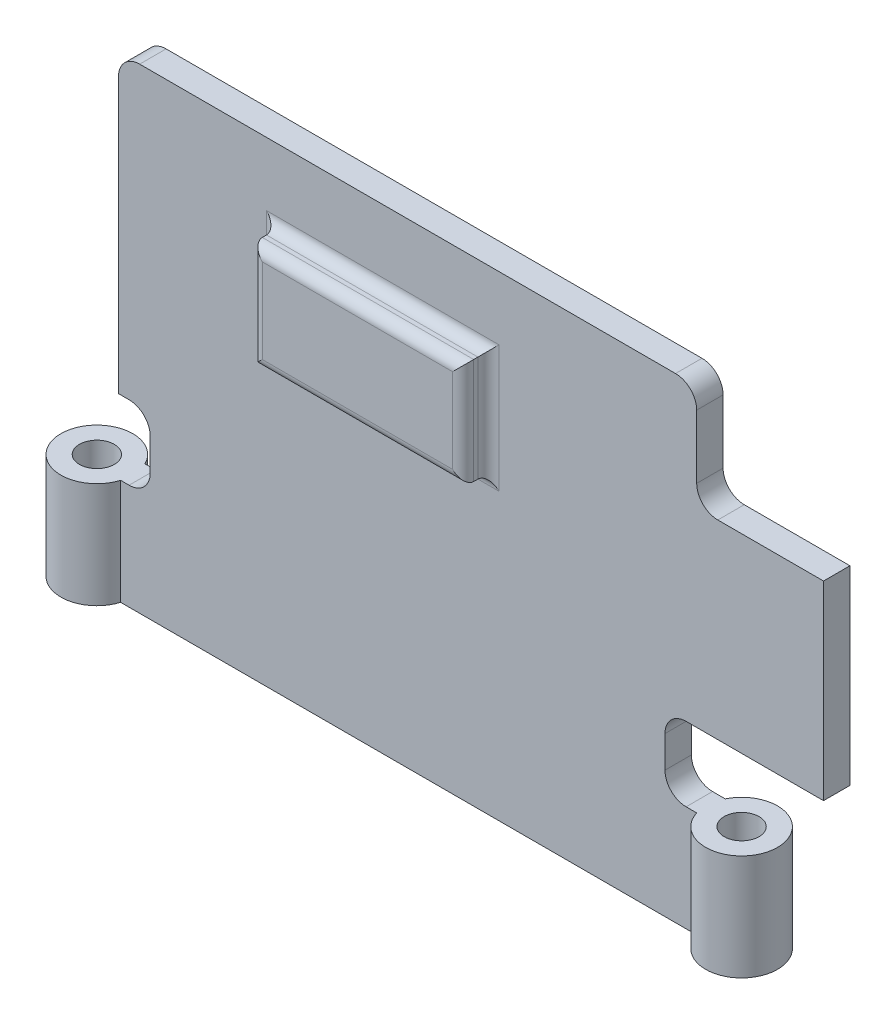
ISO-10303-21;
HEADER;
FILE_DESCRIPTION(('STEP AP214'),'2;1');
FILE_NAME('part.step','',(''),(''),'','','');
FILE_SCHEMA(('AUTOMOTIVE_DESIGN { 1 0 10303 214 1 1 1 1 }'));
ENDSEC;
DATA;
#1=APPLICATION_CONTEXT('core data for automotive mechanical design processes');
#2=APPLICATION_PROTOCOL_DEFINITION('international standard','automotive_design',2000,#1);
#3=PRODUCT_CONTEXT('',#1,'mechanical');
#4=PRODUCT('Part','Part','',(#3));
#5=PRODUCT_RELATED_PRODUCT_CATEGORY('part','',(#4));
#6=PRODUCT_DEFINITION_FORMATION('','',#4);
#7=PRODUCT_DEFINITION_CONTEXT('part definition',#1,'design');
#8=PRODUCT_DEFINITION('design','',#6,#7);
#9=PRODUCT_DEFINITION_SHAPE('','',#8);
#10=(LENGTH_UNIT() NAMED_UNIT(*) SI_UNIT(.MILLI.,.METRE.));
#11=(NAMED_UNIT(*) PLANE_ANGLE_UNIT() SI_UNIT($,.RADIAN.));
#12=(NAMED_UNIT(*) SI_UNIT($,.STERADIAN.) SOLID_ANGLE_UNIT());
#13=UNCERTAINTY_MEASURE_WITH_UNIT(LENGTH_MEASURE(1.E-05),#10,'distance_accuracy_value','');
#14=(GEOMETRIC_REPRESENTATION_CONTEXT(3) GLOBAL_UNCERTAINTY_ASSIGNED_CONTEXT((#13)) GLOBAL_UNIT_ASSIGNED_CONTEXT((#10,
#11,#12)) REPRESENTATION_CONTEXT('',''));
#15=CARTESIAN_POINT('',(0.,0.,0.));
#16=DIRECTION('',(0.,0.,1.));
#17=DIRECTION('',(1.,0.,0.));
#18=AXIS2_PLACEMENT_3D('',#15,#16,#17);
#19=CARTESIAN_POINT('',(-27.2503846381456,10.,1.));
#20=DIRECTION('',(0.,0.,-1.));
#21=DIRECTION('',(-1.,0.,0.));
#22=AXIS2_PLACEMENT_3D('',#19,#20,#21);
#23=PLANE('',#22);
#24=DIRECTION('',(-1.,0.,0.));
#25=VECTOR('',#24,1.);
#26=CARTESIAN_POINT('',(7.55122926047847,39.,1.));
#27=LINE('',#26,#25);
#28=CARTESIAN_POINT('',(-13.4487707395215,39.,1.));
#29=VERTEX_POINT('',#28);
#30=CARTESIAN_POINT('',(8.55122926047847,39.,1.));
#31=VERTEX_POINT('',#30);
#32=EDGE_CURVE('E533',#29,#31,#27,.F.);
#33=ORIENTED_EDGE('',*,*,#32,.T.);
#34=DIRECTION('',(0.,1.,0.));
#35=VECTOR('',#34,1.);
#36=CARTESIAN_POINT('',(8.55122926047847,28.,1.));
#37=LINE('',#36,#35);
#38=CARTESIAN_POINT('',(8.55122926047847,27.,1.));
#39=VERTEX_POINT('',#38);
#40=EDGE_CURVE('E11',#31,#39,#37,.F.);
#41=ORIENTED_EDGE('',*,*,#40,.T.);
#42=DIRECTION('',(1.,0.,0.));
#43=VECTOR('',#42,1.);
#44=CARTESIAN_POINT('',(-12.4487707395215,27.,1.));
#45=LINE('',#44,#43);
#46=CARTESIAN_POINT('',(-13.4487707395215,27.,1.));
#47=VERTEX_POINT('',#46);
#48=EDGE_CURVE('E44',#39,#47,#45,.F.);
#49=ORIENTED_EDGE('',*,*,#48,.T.);
#50=DIRECTION('',(0.,-1.,0.));
#51=VECTOR('',#50,1.);
#52=CARTESIAN_POINT('',(-13.4487707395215,38.,1.));
#53=LINE('',#52,#51);
#54=EDGE_CURVE('E535',#47,#29,#53,.F.);
#55=ORIENTED_EDGE('',*,*,#54,.T.);
#56=EDGE_LOOP('',(#33,#41,#49,#55));
#57=FACE_BOUND('',#56,.T.);
#58=DIRECTION('',(0.,-1.,0.));
#59=VECTOR('',#58,1.);
#60=CARTESIAN_POINT('',(27.2503846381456,45.,1.));
#61=LINE('',#60,#59);
#62=CARTESIAN_POINT('',(27.2503846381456,43.,1.));
#63=VERTEX_POINT('',#62);
#64=CARTESIAN_POINT('',(27.2503846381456,37.,1.));
#65=VERTEX_POINT('',#64);
#66=EDGE_CURVE('E395',#63,#65,#61,.T.);
#67=ORIENTED_EDGE('',*,*,#66,.F.);
#68=CARTESIAN_POINT('',(25.2503846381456,43.,1.));
#69=DIRECTION('',(0.,0.,-1.));
#70=DIRECTION('',(-1.,0.,0.));
#71=AXIS2_PLACEMENT_3D('',#68,#69,#70);
#72=CIRCLE('',#71,2.);
#73=CARTESIAN_POINT('',(25.2503846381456,45.,1.));
#74=VERTEX_POINT('',#73);
#75=EDGE_CURVE('E472',#63,#74,#72,.F.);
#76=ORIENTED_EDGE('',*,*,#75,.T.);
#77=DIRECTION('',(1.,0.,0.));
#78=VECTOR('',#77,1.);
#79=CARTESIAN_POINT('',(-27.4487707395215,45.,1.));
#80=LINE('',#79,#78);
#81=CARTESIAN_POINT('',(-25.4487707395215,45.,1.));
#82=VERTEX_POINT('',#81);
#83=EDGE_CURVE('E379',#82,#74,#80,.T.);
#84=ORIENTED_EDGE('',*,*,#83,.F.);
#85=CARTESIAN_POINT('',(-25.4487707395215,43.,1.));
#86=DIRECTION('',(0.,0.,-1.));
#87=DIRECTION('',(-1.,0.,0.));
#88=AXIS2_PLACEMENT_3D('',#85,#86,#87);
#89=CIRCLE('',#88,2.);
#90=CARTESIAN_POINT('',(-27.4487707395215,43.,1.));
#91=VERTEX_POINT('',#90);
#92=EDGE_CURVE('E470',#82,#91,#89,.F.);
#93=ORIENTED_EDGE('',*,*,#92,.T.);
#94=DIRECTION('',(0.,-1.,0.));
#95=VECTOR('',#94,1.);
#96=CARTESIAN_POINT('',(-27.4487707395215,45.,1.));
#97=LINE('',#96,#95);
#98=CARTESIAN_POINT('',(-27.4487707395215,17.,1.));
#99=VERTEX_POINT('',#98);
#100=EDGE_CURVE('E398',#91,#99,#97,.T.);
#101=ORIENTED_EDGE('',*,*,#100,.T.);
#102=DIRECTION('',(-1.,0.,0.));
#103=VECTOR('',#102,1.);
#104=CARTESIAN_POINT('',(-24.4487707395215,17.,1.));
#105=LINE('',#104,#103);
#106=CARTESIAN_POINT('',(-26.4487707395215,17.,1.));
#107=VERTEX_POINT('',#106);
#108=EDGE_CURVE('E380',#107,#99,#105,.T.);
#109=ORIENTED_EDGE('',*,*,#108,.F.);
#110=CARTESIAN_POINT('',(-26.4487707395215,15.,1.));
#111=DIRECTION('',(0.,0.,-1.));
#112=DIRECTION('',(-1.,0.,0.));
#113=AXIS2_PLACEMENT_3D('',#110,#111,#112);
#114=CIRCLE('',#113,2.);
#115=CARTESIAN_POINT('',(-24.4487707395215,15.,1.));
#116=VERTEX_POINT('',#115);
#117=EDGE_CURVE('E500',#107,#116,#114,.T.);
#118=ORIENTED_EDGE('',*,*,#117,.T.);
#119=DIRECTION('',(0.,1.,0.));
#120=VECTOR('',#119,1.);
#121=CARTESIAN_POINT('',(-24.4487707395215,10.,1.));
#122=LINE('',#121,#120);
#123=CARTESIAN_POINT('',(-24.4487707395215,12.,1.));
#124=VERTEX_POINT('',#123);
#125=EDGE_CURVE('E370',#124,#116,#122,.T.);
#126=ORIENTED_EDGE('',*,*,#125,.F.);
#127=CARTESIAN_POINT('',(-26.4487707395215,12.,1.));
#128=DIRECTION('',(0.,0.,-1.));
#129=DIRECTION('',(-1.,0.,0.));
#130=AXIS2_PLACEMENT_3D('',#127,#128,#129);
#131=CIRCLE('',#130,2.);
#132=CARTESIAN_POINT('',(-26.4487707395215,10.,1.));
#133=VERTEX_POINT('',#132);
#134=EDGE_CURVE('E502',#124,#133,#131,.T.);
#135=ORIENTED_EDGE('',*,*,#134,.T.);
#136=DIRECTION('',(-1.,0.,0.));
#137=VECTOR('',#136,1.);
#138=CARTESIAN_POINT('',(-24.4487707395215,10.,1.));
#139=LINE('',#138,#137);
#140=CARTESIAN_POINT('',(-27.2503846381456,10.,1.));
#141=VERTEX_POINT('',#140);
#142=EDGE_CURVE('E382',#133,#141,#139,.T.);
#143=ORIENTED_EDGE('',*,*,#142,.T.);
#144=DIRECTION('',(0.,-1.,0.));
#145=VECTOR('',#144,1.);
#146=CARTESIAN_POINT('',(-27.2503846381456,10.,1.));
#147=LINE('',#146,#145);
#148=CARTESIAN_POINT('',(-27.2503846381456,0.,1.));
#149=VERTEX_POINT('',#148);
#150=EDGE_CURVE('E434',#141,#149,#147,.T.);
#151=ORIENTED_EDGE('',*,*,#150,.T.);
#152=DIRECTION('',(1.,0.,0.));
#153=VECTOR('',#152,1.);
#154=CARTESIAN_POINT('',(-27.2503846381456,0.,1.));
#155=LINE('',#154,#153);
#156=CARTESIAN_POINT('',(27.2503846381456,0.,1.));
#157=VERTEX_POINT('',#156);
#158=EDGE_CURVE('E418',#149,#157,#155,.T.);
#159=ORIENTED_EDGE('',*,*,#158,.T.);
#160=DIRECTION('',(0.,-1.,0.));
#161=VECTOR('',#160,1.);
#162=CARTESIAN_POINT('',(27.2503846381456,10.,1.));
#163=LINE('',#162,#161);
#164=CARTESIAN_POINT('',(27.2503846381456,10.,1.));
#165=VERTEX_POINT('',#164);
#166=EDGE_CURVE('E424',#165,#157,#163,.T.);
#167=ORIENTED_EDGE('',*,*,#166,.F.);
#168=DIRECTION('',(1.,0.,0.));
#169=VECTOR('',#168,1.);
#170=CARTESIAN_POINT('',(24.2503846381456,10.,1.));
#171=LINE('',#170,#169);
#172=CARTESIAN_POINT('',(26.2503846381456,10.,1.));
#173=VERTEX_POINT('',#172);
#174=EDGE_CURVE('E361',#173,#165,#171,.T.);
#175=ORIENTED_EDGE('',*,*,#174,.F.);
#176=CARTESIAN_POINT('',(26.2503846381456,12.,1.));
#177=DIRECTION('',(0.,0.,-1.));
#178=DIRECTION('',(-1.,0.,0.));
#179=AXIS2_PLACEMENT_3D('',#176,#177,#178);
#180=CIRCLE('',#179,2.);
#181=CARTESIAN_POINT('',(24.2503846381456,12.,1.));
#182=VERTEX_POINT('',#181);
#183=EDGE_CURVE('E488',#173,#182,#180,.T.);
#184=ORIENTED_EDGE('',*,*,#183,.T.);
#185=DIRECTION('',(0.,-1.,0.));
#186=VECTOR('',#185,1.);
#187=CARTESIAN_POINT('',(24.2503846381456,10.,1.));
#188=LINE('',#187,#186);
#189=CARTESIAN_POINT('',(24.2503846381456,15.,1.));
#190=VERTEX_POINT('',#189);
#191=EDGE_CURVE('E357',#190,#182,#188,.T.);
#192=ORIENTED_EDGE('',*,*,#191,.F.);
#193=CARTESIAN_POINT('',(26.2503846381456,15.,1.));
#194=DIRECTION('',(0.,0.,-1.));
#195=DIRECTION('',(-1.,0.,0.));
#196=AXIS2_PLACEMENT_3D('',#193,#194,#195);
#197=CIRCLE('',#196,2.);
#198=CARTESIAN_POINT('',(26.2503846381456,17.,1.));
#199=VERTEX_POINT('',#198);
#200=EDGE_CURVE('E490',#190,#199,#197,.T.);
#201=ORIENTED_EDGE('',*,*,#200,.T.);
#202=DIRECTION('',(1.,0.,0.));
#203=VECTOR('',#202,1.);
#204=CARTESIAN_POINT('',(24.2503846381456,17.,1.));
#205=LINE('',#204,#203);
#206=CARTESIAN_POINT('',(39.2503846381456,17.,1.));
#207=VERTEX_POINT('',#206);
#208=EDGE_CURVE('E364',#199,#207,#205,.T.);
#209=ORIENTED_EDGE('',*,*,#208,.T.);
#210=DIRECTION('',(0.,-1.,0.));
#211=VECTOR('',#210,1.);
#212=CARTESIAN_POINT('',(39.2503846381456,17.,1.));
#213=LINE('',#212,#211);
#214=CARTESIAN_POINT('',(39.2503846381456,35.,1.));
#215=VERTEX_POINT('',#214);
#216=EDGE_CURVE('E342',#215,#207,#213,.T.);
#217=ORIENTED_EDGE('',*,*,#216,.F.);
#218=DIRECTION('',(-1.,0.,0.));
#219=VECTOR('',#218,1.);
#220=CARTESIAN_POINT('',(39.2503846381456,35.,1.));
#221=LINE('',#220,#219);
#222=CARTESIAN_POINT('',(29.2503846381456,35.,1.));
#223=VERTEX_POINT('',#222);
#224=EDGE_CURVE('E348',#215,#223,#221,.T.);
#225=ORIENTED_EDGE('',*,*,#224,.T.);
#226=CARTESIAN_POINT('',(29.2503846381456,37.,1.));
#227=DIRECTION('',(0.,0.,-1.));
#228=DIRECTION('',(-1.,0.,0.));
#229=AXIS2_PLACEMENT_3D('',#226,#227,#228);
#230=CIRCLE('',#229,2.);
#231=EDGE_CURVE('E494',#223,#65,#230,.T.);
#232=ORIENTED_EDGE('',*,*,#231,.T.);
#233=EDGE_LOOP('',(#67,#76,#84,#93,#101,#109,#118,#126,#135,#143,#151,#159,#167,#175,#184,#192,
#201,#209,#217,#225,#232));
#234=FACE_BOUND('',#233,.T.);
#235=ADVANCED_FACE('F35',(#57,#234),#23,.F.);
#236=CARTESIAN_POINT('',(27.2503846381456,45.,-1.5));
#237=DIRECTION('',(-1.,0.,0.));
#238=DIRECTION('',(0.,0.,1.));
#239=AXIS2_PLACEMENT_3D('',#236,#237,#238);
#240=PLANE('',#239);
#241=ORIENTED_EDGE('',*,*,#66,.T.);
#242=DIRECTION('',(0.,0.,1.));
#243=VECTOR('',#242,1.);
#244=CARTESIAN_POINT('',(27.2503846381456,37.,-1.5));
#245=LINE('',#244,#243);
#246=CARTESIAN_POINT('',(27.2503846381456,37.,-1.5));
#247=VERTEX_POINT('',#246);
#248=EDGE_CURVE('E458',#65,#247,#245,.F.);
#249=ORIENTED_EDGE('',*,*,#248,.T.);
#250=DIRECTION('',(0.,-1.,0.));
#251=VECTOR('',#250,1.);
#252=CARTESIAN_POINT('',(27.2503846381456,45.,-1.5));
#253=LINE('',#252,#251);
#254=CARTESIAN_POINT('',(27.2503846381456,43.,-1.5));
#255=VERTEX_POINT('',#254);
#256=EDGE_CURVE('E392',#255,#247,#253,.T.);
#257=ORIENTED_EDGE('',*,*,#256,.F.);
#258=DIRECTION('',(0.,0.,-1.));
#259=VECTOR('',#258,1.);
#260=CARTESIAN_POINT('',(27.2503846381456,43.,1.));
#261=LINE('',#260,#259);
#262=EDGE_CURVE('E456',#255,#63,#261,.F.);
#263=ORIENTED_EDGE('',*,*,#262,.T.);
#264=EDGE_LOOP('',(#241,#249,#257,#263));
#265=FACE_BOUND('',#264,.T.);
#266=ADVANCED_FACE('F608',(#265),#240,.F.);
#267=CARTESIAN_POINT('',(30.5,10.,0.));
#268=DIRECTION('',(0.,-1.,0.));
#269=DIRECTION('',(0.,0.,-1.));
#270=AXIS2_PLACEMENT_3D('',#267,#268,#269);
#271=PLANE('',#270);
#272=CARTESIAN_POINT('',(30.5,10.,0.));
#273=DIRECTION('',(0.,1.,0.));
#274=DIRECTION('',(0.,0.,1.));
#275=AXIS2_PLACEMENT_3D('',#272,#273,#274);
#276=CIRCLE('',#275,1.65);
#277=CARTESIAN_POINT('',(30.5,10.,1.65));
#278=VERTEX_POINT('',#277);
#279=EDGE_CURVE('E402',#278,#278,#276,.T.);
#280=ORIENTED_EDGE('',*,*,#279,.F.);
#281=EDGE_LOOP('',(#280));
#282=FACE_BOUND('',#281,.T.);
#283=DIRECTION('',(-1.,0.,0.));
#284=VECTOR('',#283,1.);
#285=CARTESIAN_POINT('',(-27.4487707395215,10.,-1.5));
#286=LINE('',#285,#284);
#287=CARTESIAN_POINT('',(27.4487707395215,10.,-1.5));
#288=VERTEX_POINT('',#287);
#289=CARTESIAN_POINT('',(26.2503846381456,10.,-1.5));
#290=VERTEX_POINT('',#289);
#291=EDGE_CURVE('E417',#288,#290,#286,.T.);
#292=ORIENTED_EDGE('',*,*,#291,.T.);
#293=DIRECTION('',(0.,0.,-1.));
#294=VECTOR('',#293,1.);
#295=CARTESIAN_POINT('',(26.2503846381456,10.,0.));
#296=LINE('',#295,#294);
#297=EDGE_CURVE('E449',#290,#173,#296,.F.);
#298=ORIENTED_EDGE('',*,*,#297,.T.);
#299=ORIENTED_EDGE('',*,*,#174,.T.);
#300=CARTESIAN_POINT('',(30.5,10.,0.));
#301=DIRECTION('',(0.,1.,0.));
#302=DIRECTION('',(0.,0.,-1.));
#303=AXIS2_PLACEMENT_3D('',#300,#301,#302);
#304=CIRCLE('',#303,3.4);
#305=EDGE_CURVE('E414',#165,#288,#304,.T.);
#306=ORIENTED_EDGE('',*,*,#305,.T.);
#307=EDGE_LOOP('',(#292,#298,#299,#306));
#308=FACE_BOUND('',#307,.T.);
#309=ADVANCED_FACE('F613',(#282,#308),#271,.F.);
#310=ORIENTED_EDGE('',*,*,#142,.F.);
#311=DIRECTION('',(0.,0.,1.));
#312=VECTOR('',#311,1.);
#313=CARTESIAN_POINT('',(-26.4487707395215,10.,-1.5));
#314=LINE('',#313,#312);
#315=CARTESIAN_POINT('',(-26.4487707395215,10.,-1.5));
#316=VERTEX_POINT('',#315);
#317=EDGE_CURVE('E484',#133,#316,#314,.F.);
#318=ORIENTED_EDGE('',*,*,#317,.T.);
#319=DIRECTION('',(-1.,0.,0.));
#320=VECTOR('',#319,1.);
#321=CARTESIAN_POINT('',(-24.4487707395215,10.,-1.5));
#322=LINE('',#321,#320);
#323=CARTESIAN_POINT('',(-27.4487707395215,10.,-1.5));
#324=VERTEX_POINT('',#323);
#325=EDGE_CURVE('E373',#316,#324,#322,.T.);
#326=ORIENTED_EDGE('',*,*,#325,.T.);
#327=CARTESIAN_POINT('',(-30.5,10.,0.));
#328=DIRECTION('',(0.,1.,0.));
#329=DIRECTION('',(0.,0.,1.));
#330=AXIS2_PLACEMENT_3D('',#327,#328,#329);
#331=CIRCLE('',#330,3.4);
#332=EDGE_CURVE('E421',#324,#141,#331,.T.);
#333=ORIENTED_EDGE('',*,*,#332,.T.);
#334=EDGE_LOOP('',(#310,#318,#326,#333));
#335=FACE_BOUND('',#334,.T.);
#336=CARTESIAN_POINT('',(-30.5,10.,0.));
#337=DIRECTION('',(0.,1.,0.));
#338=DIRECTION('',(0.,0.,1.));
#339=AXIS2_PLACEMENT_3D('',#336,#337,#338);
#340=CIRCLE('',#339,1.65);
#341=CARTESIAN_POINT('',(-30.5,10.,1.65));
#342=VERTEX_POINT('',#341);
#343=EDGE_CURVE('E408',#342,#342,#340,.T.);
#344=ORIENTED_EDGE('',*,*,#343,.F.);
#345=EDGE_LOOP('',(#344));
#346=FACE_BOUND('',#345,.T.);
#347=ADVANCED_FACE('F736',(#335,#346),#271,.F.);
#348=CARTESIAN_POINT('',(30.5,0.,0.));
#349=DIRECTION('',(0.,-1.,0.));
#350=DIRECTION('',(0.,0.,-1.));
#351=AXIS2_PLACEMENT_3D('',#348,#349,#350);
#352=PLANE('',#351);
#353=CARTESIAN_POINT('',(-30.5,0.,0.));
#354=DIRECTION('',(0.,1.,0.));
#355=DIRECTION('',(0.,0.,1.));
#356=AXIS2_PLACEMENT_3D('',#353,#354,#355);
#357=CIRCLE('',#356,1.65);
#358=CARTESIAN_POINT('',(-30.5,0.,1.65));
#359=VERTEX_POINT('',#358);
#360=EDGE_CURVE('E405',#359,#359,#357,.T.);
#361=ORIENTED_EDGE('',*,*,#360,.T.);
#362=EDGE_LOOP('',(#361));
#363=FACE_BOUND('',#362,.T.);
#364=CARTESIAN_POINT('',(30.5,0.,0.));
#365=DIRECTION('',(0.,1.,0.));
#366=DIRECTION('',(0.,0.,-1.));
#367=AXIS2_PLACEMENT_3D('',#364,#365,#366);
#368=CIRCLE('',#367,3.4);
#369=CARTESIAN_POINT('',(27.4487707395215,0.,-1.5));
#370=VERTEX_POINT('',#369);
#371=EDGE_CURVE('E411',#157,#370,#368,.T.);
#372=ORIENTED_EDGE('',*,*,#371,.F.);
#373=ORIENTED_EDGE('',*,*,#158,.F.);
#374=CARTESIAN_POINT('',(-30.5,0.,0.));
#375=DIRECTION('',(0.,1.,0.));
#376=DIRECTION('',(0.,0.,1.));
#377=AXIS2_PLACEMENT_3D('',#374,#375,#376);
#378=CIRCLE('',#377,3.4);
#379=CARTESIAN_POINT('',(-27.4487707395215,0.,-1.5));
#380=VERTEX_POINT('',#379);
#381=EDGE_CURVE('E429',#380,#149,#378,.T.);
#382=ORIENTED_EDGE('',*,*,#381,.F.);
#383=DIRECTION('',(-1.,0.,0.));
#384=VECTOR('',#383,1.);
#385=CARTESIAN_POINT('',(-27.4487707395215,0.,-1.5));
#386=LINE('',#385,#384);
#387=EDGE_CURVE('E427',#370,#380,#386,.T.);
#388=ORIENTED_EDGE('',*,*,#387,.F.);
#389=EDGE_LOOP('',(#372,#373,#382,#388));
#390=FACE_BOUND('',#389,.T.);
#391=CARTESIAN_POINT('',(30.5,0.,0.));
#392=DIRECTION('',(0.,1.,0.));
#393=DIRECTION('',(0.,0.,1.));
#394=AXIS2_PLACEMENT_3D('',#391,#392,#393);
#395=CIRCLE('',#394,1.65);
#396=CARTESIAN_POINT('',(30.5,0.,1.65));
#397=VERTEX_POINT('',#396);
#398=EDGE_CURVE('E401',#397,#397,#395,.T.);
#399=ORIENTED_EDGE('',*,*,#398,.T.);
#400=EDGE_LOOP('',(#399));
#401=FACE_BOUND('',#400,.T.);
#402=ADVANCED_FACE('F618',(#363,#390,#401),#352,.T.);
#403=CARTESIAN_POINT('',(30.5,10.,0.));
#404=DIRECTION('',(0.,-1.,0.));
#405=DIRECTION('',(0.,0.,-1.));
#406=AXIS2_PLACEMENT_3D('',#403,#404,#405);
#407=CYLINDRICAL_SURFACE('',#406,3.4);
#408=ORIENTED_EDGE('',*,*,#371,.T.);
#409=DIRECTION('',(0.,-1.,0.));
#410=VECTOR('',#409,1.);
#411=CARTESIAN_POINT('',(27.4487707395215,10.,-1.5));
#412=LINE('',#411,#410);
#413=EDGE_CURVE('E440',#288,#370,#412,.T.);
#414=ORIENTED_EDGE('',*,*,#413,.F.);
#415=ORIENTED_EDGE('',*,*,#305,.F.);
#416=ORIENTED_EDGE('',*,*,#166,.T.);
#417=EDGE_LOOP('',(#408,#414,#415,#416));
#418=FACE_BOUND('',#417,.T.);
#419=ADVANCED_FACE('F628',(#418),#407,.T.);
#420=CARTESIAN_POINT('',(-27.4487707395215,10.,-1.5));
#421=DIRECTION('',(0.,0.,1.));
#422=DIRECTION('',(1.,0.,0.));
#423=AXIS2_PLACEMENT_3D('',#420,#421,#422);
#424=PLANE('',#423);
#425=DIRECTION('',(0.,-1.,0.));
#426=VECTOR('',#425,1.);
#427=CARTESIAN_POINT('',(22.5822563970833,0.,-1.5));
#428=LINE('',#427,#426);
#429=CARTESIAN_POINT('',(22.5822563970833,26.,-1.5));
#430=VERTEX_POINT('',#429);
#431=CARTESIAN_POINT('',(22.5822563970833,21.,-1.5));
#432=VERTEX_POINT('',#431);
#433=EDGE_CURVE('E305',#430,#432,#428,.T.);
#434=ORIENTED_EDGE('',*,*,#433,.T.);
#435=DIRECTION('',(1.,0.,0.));
#436=VECTOR('',#435,1.);
#437=CARTESIAN_POINT('',(0.,21.,-1.5));
#438=LINE('',#437,#436);
#439=CARTESIAN_POINT('',(24.5,21.,-1.5));
#440=VERTEX_POINT('',#439);
#441=EDGE_CURVE('E272',#432,#440,#438,.T.);
#442=ORIENTED_EDGE('',*,*,#441,.T.);
#443=DIRECTION('',(0.,1.,0.));
#444=VECTOR('',#443,1.);
#445=CARTESIAN_POINT('',(24.5,0.,-1.5));
#446=LINE('',#445,#444);
#447=CARTESIAN_POINT('',(24.5,28.,-1.5));
#448=VERTEX_POINT('',#447);
#449=EDGE_CURVE('E289',#440,#448,#446,.T.);
#450=ORIENTED_EDGE('',*,*,#449,.T.);
#451=DIRECTION('',(-1.,0.,0.));
#452=VECTOR('',#451,1.);
#453=CARTESIAN_POINT('',(0.,28.,-1.5));
#454=LINE('',#453,#452);
#455=CARTESIAN_POINT('',(5.58225639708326,28.,-1.5));
#456=VERTEX_POINT('',#455);
#457=EDGE_CURVE('E52',#448,#456,#454,.T.);
#458=ORIENTED_EDGE('',*,*,#457,.T.);
#459=DIRECTION('',(0.,-1.,0.));
#460=VECTOR('',#459,1.);
#461=CARTESIAN_POINT('',(5.58225639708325,0.,-1.5));
#462=LINE('',#461,#460);
#463=CARTESIAN_POINT('',(5.58225639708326,26.,-1.5));
#464=VERTEX_POINT('',#463);
#465=EDGE_CURVE('E310',#456,#464,#462,.T.);
#466=ORIENTED_EDGE('',*,*,#465,.T.);
#467=DIRECTION('',(1.,0.,0.));
#468=VECTOR('',#467,1.);
#469=CARTESIAN_POINT('',(0.,26.,-1.5));
#470=LINE('',#469,#468);
#471=EDGE_CURVE('E307',#464,#430,#470,.T.);
#472=ORIENTED_EDGE('',*,*,#471,.T.);
#473=EDGE_LOOP('',(#434,#442,#450,#458,#466,#472));
#474=FACE_BOUND('',#473,.T.);
#475=DIRECTION('',(-1.,0.,0.));
#476=VECTOR('',#475,1.);
#477=CARTESIAN_POINT('',(-27.4487707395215,45.,-1.5));
#478=LINE('',#477,#476);
#479=CARTESIAN_POINT('',(25.2503846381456,45.,-1.5));
#480=VERTEX_POINT('',#479);
#481=CARTESIAN_POINT('',(-25.4487707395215,45.,-1.5));
#482=VERTEX_POINT('',#481);
#483=EDGE_CURVE('E387',#480,#482,#478,.T.);
#484=ORIENTED_EDGE('',*,*,#483,.F.);
#485=CARTESIAN_POINT('',(25.2503846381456,43.,-1.5));
#486=DIRECTION('',(0.,0.,1.));
#487=DIRECTION('',(1.,0.,0.));
#488=AXIS2_PLACEMENT_3D('',#485,#486,#487);
#489=CIRCLE('',#488,2.);
#490=EDGE_CURVE('E468',#480,#255,#489,.F.);
#491=ORIENTED_EDGE('',*,*,#490,.T.);
#492=ORIENTED_EDGE('',*,*,#256,.T.);
#493=CARTESIAN_POINT('',(29.2503846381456,37.,-1.5));
#494=DIRECTION('',(0.,0.,1.));
#495=DIRECTION('',(1.,0.,0.));
#496=AXIS2_PLACEMENT_3D('',#493,#494,#495);
#497=CIRCLE('',#496,2.);
#498=CARTESIAN_POINT('',(29.2503846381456,35.,-1.5));
#499=VERTEX_POINT('',#498);
#500=EDGE_CURVE('E496',#247,#499,#497,.T.);
#501=ORIENTED_EDGE('',*,*,#500,.T.);
#502=DIRECTION('',(-1.,0.,0.));
#503=VECTOR('',#502,1.);
#504=CARTESIAN_POINT('',(39.2503846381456,35.,-1.5));
#505=LINE('',#504,#503);
#506=CARTESIAN_POINT('',(39.2503846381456,35.,-1.5));
#507=VERTEX_POINT('',#506);
#508=EDGE_CURVE('E351',#507,#499,#505,.T.);
#509=ORIENTED_EDGE('',*,*,#508,.F.);
#510=DIRECTION('',(0.,1.,0.));
#511=VECTOR('',#510,1.);
#512=CARTESIAN_POINT('',(39.2503846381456,17.,-1.5));
#513=LINE('',#512,#511);
#514=CARTESIAN_POINT('',(39.2503846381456,17.,-1.5));
#515=VERTEX_POINT('',#514);
#516=EDGE_CURVE('E337',#515,#507,#513,.T.);
#517=ORIENTED_EDGE('',*,*,#516,.F.);
#518=DIRECTION('',(1.,0.,0.));
#519=VECTOR('',#518,1.);
#520=CARTESIAN_POINT('',(24.2503846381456,17.,-1.5));
#521=LINE('',#520,#519);
#522=CARTESIAN_POINT('',(26.2503846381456,17.,-1.5));
#523=VERTEX_POINT('',#522);
#524=EDGE_CURVE('E360',#523,#515,#521,.T.);
#525=ORIENTED_EDGE('',*,*,#524,.F.);
#526=CARTESIAN_POINT('',(26.2503846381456,15.,-1.5));
#527=DIRECTION('',(0.,0.,1.));
#528=DIRECTION('',(1.,0.,0.));
#529=AXIS2_PLACEMENT_3D('',#526,#527,#528);
#530=CIRCLE('',#529,2.);
#531=CARTESIAN_POINT('',(24.2503846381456,15.,-1.5));
#532=VERTEX_POINT('',#531);
#533=EDGE_CURVE('E492',#523,#532,#530,.T.);
#534=ORIENTED_EDGE('',*,*,#533,.T.);
#535=DIRECTION('',(0.,1.,0.));
#536=VECTOR('',#535,1.);
#537=CARTESIAN_POINT('',(24.2503846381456,10.,-1.5));
#538=LINE('',#537,#536);
#539=CARTESIAN_POINT('',(24.2503846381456,12.,-1.5));
#540=VERTEX_POINT('',#539);
#541=EDGE_CURVE('E354',#540,#532,#538,.T.);
#542=ORIENTED_EDGE('',*,*,#541,.F.);
#543=CARTESIAN_POINT('',(26.2503846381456,12.,-1.5));
#544=DIRECTION('',(0.,0.,1.));
#545=DIRECTION('',(1.,0.,0.));
#546=AXIS2_PLACEMENT_3D('',#543,#544,#545);
#547=CIRCLE('',#546,2.);
#548=EDGE_CURVE('E486',#540,#290,#547,.T.);
#549=ORIENTED_EDGE('',*,*,#548,.T.);
#550=ORIENTED_EDGE('',*,*,#291,.F.);
#551=ORIENTED_EDGE('',*,*,#413,.T.);
#552=ORIENTED_EDGE('',*,*,#387,.T.);
#553=DIRECTION('',(0.,-1.,0.));
#554=VECTOR('',#553,1.);
#555=CARTESIAN_POINT('',(-27.4487707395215,10.,-1.5));
#556=LINE('',#555,#554);
#557=EDGE_CURVE('E437',#324,#380,#556,.T.);
#558=ORIENTED_EDGE('',*,*,#557,.F.);
#559=ORIENTED_EDGE('',*,*,#325,.F.);
#560=CARTESIAN_POINT('',(-26.4487707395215,12.,-1.5));
#561=DIRECTION('',(0.,0.,1.));
#562=DIRECTION('',(1.,0.,0.));
#563=AXIS2_PLACEMENT_3D('',#560,#561,#562);
#564=CIRCLE('',#563,2.);
#565=CARTESIAN_POINT('',(-24.4487707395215,12.,-1.5));
#566=VERTEX_POINT('',#565);
#567=EDGE_CURVE('E504',#316,#566,#564,.T.);
#568=ORIENTED_EDGE('',*,*,#567,.T.);
#569=DIRECTION('',(0.,-1.,0.));
#570=VECTOR('',#569,1.);
#571=CARTESIAN_POINT('',(-24.4487707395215,10.,-1.5));
#572=LINE('',#571,#570);
#573=CARTESIAN_POINT('',(-24.4487707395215,15.,-1.5));
#574=VERTEX_POINT('',#573);
#575=EDGE_CURVE('E367',#574,#566,#572,.T.);
#576=ORIENTED_EDGE('',*,*,#575,.F.);
#577=CARTESIAN_POINT('',(-26.4487707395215,15.,-1.5));
#578=DIRECTION('',(0.,0.,1.));
#579=DIRECTION('',(1.,0.,0.));
#580=AXIS2_PLACEMENT_3D('',#577,#578,#579);
#581=CIRCLE('',#580,2.);
#582=CARTESIAN_POINT('',(-26.4487707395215,17.,-1.5));
#583=VERTEX_POINT('',#582);
#584=EDGE_CURVE('E498',#574,#583,#581,.T.);
#585=ORIENTED_EDGE('',*,*,#584,.T.);
#586=DIRECTION('',(-1.,0.,0.));
#587=VECTOR('',#586,1.);
#588=CARTESIAN_POINT('',(-24.4487707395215,17.,-1.5));
#589=LINE('',#588,#587);
#590=CARTESIAN_POINT('',(-27.4487707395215,17.,-1.5));
#591=VERTEX_POINT('',#590);
#592=EDGE_CURVE('E376',#583,#591,#589,.T.);
#593=ORIENTED_EDGE('',*,*,#592,.T.);
#594=DIRECTION('',(0.,-1.,0.));
#595=VECTOR('',#594,1.);
#596=CARTESIAN_POINT('',(-27.4487707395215,45.,-1.5));
#597=LINE('',#596,#595);
#598=CARTESIAN_POINT('',(-27.4487707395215,43.,-1.5));
#599=VERTEX_POINT('',#598);
#600=EDGE_CURVE('E390',#599,#591,#597,.T.);
#601=ORIENTED_EDGE('',*,*,#600,.F.);
#602=CARTESIAN_POINT('',(-25.4487707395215,43.,-1.5));
#603=DIRECTION('',(0.,0.,1.));
#604=DIRECTION('',(1.,0.,0.));
#605=AXIS2_PLACEMENT_3D('',#602,#603,#604);
#606=CIRCLE('',#605,2.);
#607=EDGE_CURVE('E466',#599,#482,#606,.F.);
#608=ORIENTED_EDGE('',*,*,#607,.T.);
#609=EDGE_LOOP('',(#484,#491,#492,#501,#509,#517,#525,#534,#542,#549,#550,#551,#552,#558,#559,
#568,#576,#585,#593,#601,#608));
#610=FACE_BOUND('',#609,.T.);
#611=ADVANCED_FACE('F624',(#474,#610),#424,.F.);
#612=CARTESIAN_POINT('',(-30.5,10.,0.));
#613=DIRECTION('',(0.,-1.,0.));
#614=DIRECTION('',(0.,0.,-1.));
#615=AXIS2_PLACEMENT_3D('',#612,#613,#614);
#616=CYLINDRICAL_SURFACE('',#615,3.4);
#617=ORIENTED_EDGE('',*,*,#381,.T.);
#618=ORIENTED_EDGE('',*,*,#150,.F.);
#619=ORIENTED_EDGE('',*,*,#332,.F.);
#620=ORIENTED_EDGE('',*,*,#557,.T.);
#621=EDGE_LOOP('',(#617,#618,#619,#620));
#622=FACE_BOUND('',#621,.T.);
#623=ADVANCED_FACE('F620',(#622),#616,.T.);
#624=CARTESIAN_POINT('',(-30.5,10.,0.));
#625=DIRECTION('',(0.,-1.,0.));
#626=DIRECTION('',(0.,0.,-1.));
#627=AXIS2_PLACEMENT_3D('',#624,#625,#626);
#628=CYLINDRICAL_SURFACE('',#627,1.65);
#629=ORIENTED_EDGE('',*,*,#343,.T.);
#630=EDGE_LOOP('',(#629));
#631=FACE_BOUND('',#630,.T.);
#632=ORIENTED_EDGE('',*,*,#360,.F.);
#633=EDGE_LOOP('',(#632));
#634=FACE_BOUND('',#633,.T.);
#635=ADVANCED_FACE('F623',(#631,#634),#628,.F.);
#636=CARTESIAN_POINT('',(30.5,10.,0.));
#637=DIRECTION('',(0.,-1.,0.));
#638=DIRECTION('',(0.,0.,-1.));
#639=AXIS2_PLACEMENT_3D('',#636,#637,#638);
#640=CYLINDRICAL_SURFACE('',#639,1.65);
#641=ORIENTED_EDGE('',*,*,#279,.T.);
#642=EDGE_LOOP('',(#641));
#643=FACE_BOUND('',#642,.T.);
#644=ORIENTED_EDGE('',*,*,#398,.F.);
#645=EDGE_LOOP('',(#644));
#646=FACE_BOUND('',#645,.T.);
#647=ADVANCED_FACE('F743',(#643,#646),#640,.F.);
#648=CARTESIAN_POINT('',(-27.4487707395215,45.,-1.5));
#649=DIRECTION('',(1.,0.,0.));
#650=DIRECTION('',(0.,0.,-1.));
#651=AXIS2_PLACEMENT_3D('',#648,#649,#650);
#652=PLANE('',#651);
#653=ORIENTED_EDGE('',*,*,#100,.F.);
#654=DIRECTION('',(0.,0.,1.));
#655=VECTOR('',#654,1.);
#656=CARTESIAN_POINT('',(-27.4487707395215,43.,-1.5));
#657=LINE('',#656,#655);
#658=EDGE_CURVE('E474',#91,#599,#657,.F.);
#659=ORIENTED_EDGE('',*,*,#658,.T.);
#660=ORIENTED_EDGE('',*,*,#600,.T.);
#661=DIRECTION('',(0.,0.,-1.));
#662=VECTOR('',#661,1.);
#663=CARTESIAN_POINT('',(-27.4487707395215,17.,-1.5));
#664=LINE('',#663,#662);
#665=EDGE_CURVE('E363',#99,#591,#664,.T.);
#666=ORIENTED_EDGE('',*,*,#665,.F.);
#667=EDGE_LOOP('',(#653,#659,#660,#666));
#668=FACE_BOUND('',#667,.T.);
#669=ADVANCED_FACE('F685',(#668),#652,.F.);
#670=CARTESIAN_POINT('',(0.,45.,0.));
#671=DIRECTION('',(0.,1.,0.));
#672=DIRECTION('',(0.,0.,1.));
#673=AXIS2_PLACEMENT_3D('',#670,#671,#672);
#674=PLANE('',#673);
#675=ORIENTED_EDGE('',*,*,#83,.T.);
#676=DIRECTION('',(0.,0.,-1.));
#677=VECTOR('',#676,1.);
#678=CARTESIAN_POINT('',(25.2503846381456,45.,-1.5));
#679=LINE('',#678,#677);
#680=EDGE_CURVE('E463',#74,#480,#679,.T.);
#681=ORIENTED_EDGE('',*,*,#680,.T.);
#682=ORIENTED_EDGE('',*,*,#483,.T.);
#683=DIRECTION('',(0.,0.,1.));
#684=VECTOR('',#683,1.);
#685=CARTESIAN_POINT('',(-25.4487707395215,45.,1.));
#686=LINE('',#685,#684);
#687=EDGE_CURVE('E460',#482,#82,#686,.T.);
#688=ORIENTED_EDGE('',*,*,#687,.T.);
#689=EDGE_LOOP('',(#675,#681,#682,#688));
#690=FACE_BOUND('',#689,.T.);
#691=ADVANCED_FACE('F691',(#690),#674,.T.);
#692=CARTESIAN_POINT('',(-24.4487707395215,17.,-1.5));
#693=DIRECTION('',(0.,1.,0.));
#694=DIRECTION('',(0.,0.,1.));
#695=AXIS2_PLACEMENT_3D('',#692,#693,#694);
#696=PLANE('',#695);
#697=ORIENTED_EDGE('',*,*,#592,.F.);
#698=DIRECTION('',(0.,0.,-1.));
#699=VECTOR('',#698,1.);
#700=CARTESIAN_POINT('',(-26.4487707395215,17.,1.));
#701=LINE('',#700,#699);
#702=EDGE_CURVE('E482',#583,#107,#701,.F.);
#703=ORIENTED_EDGE('',*,*,#702,.T.);
#704=ORIENTED_EDGE('',*,*,#108,.T.);
#705=ORIENTED_EDGE('',*,*,#665,.T.);
#706=EDGE_LOOP('',(#697,#703,#704,#705));
#707=FACE_BOUND('',#706,.T.);
#708=ADVANCED_FACE('F680',(#707),#696,.F.);
#709=CARTESIAN_POINT('',(-24.4487707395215,0.,0.));
#710=DIRECTION('',(1.,0.,0.));
#711=DIRECTION('',(0.,0.,-1.));
#712=AXIS2_PLACEMENT_3D('',#709,#710,#711);
#713=PLANE('',#712);
#714=ORIENTED_EDGE('',*,*,#125,.T.);
#715=DIRECTION('',(0.,0.,-1.));
#716=VECTOR('',#715,1.);
#717=CARTESIAN_POINT('',(-24.4487707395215,15.,-1.5));
#718=LINE('',#717,#716);
#719=EDGE_CURVE('E479',#116,#574,#718,.T.);
#720=ORIENTED_EDGE('',*,*,#719,.T.);
#721=ORIENTED_EDGE('',*,*,#575,.T.);
#722=DIRECTION('',(0.,0.,1.));
#723=VECTOR('',#722,1.);
#724=CARTESIAN_POINT('',(-24.4487707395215,12.,1.));
#725=LINE('',#724,#723);
#726=EDGE_CURVE('E476',#566,#124,#725,.T.);
#727=ORIENTED_EDGE('',*,*,#726,.T.);
#728=EDGE_LOOP('',(#714,#720,#721,#727));
#729=FACE_BOUND('',#728,.T.);
#730=ADVANCED_FACE('F672',(#729),#713,.F.);
#731=CARTESIAN_POINT('',(24.2503846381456,17.,-1.5));
#732=DIRECTION('',(0.,1.,0.));
#733=DIRECTION('',(0.,0.,1.));
#734=AXIS2_PLACEMENT_3D('',#731,#732,#733);
#735=PLANE('',#734);
#736=ORIENTED_EDGE('',*,*,#208,.F.);
#737=DIRECTION('',(0.,0.,1.));
#738=VECTOR('',#737,1.);
#739=CARTESIAN_POINT('',(26.2503846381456,17.,-1.5));
#740=LINE('',#739,#738);
#741=EDGE_CURVE('E451',#199,#523,#740,.F.);
#742=ORIENTED_EDGE('',*,*,#741,.T.);
#743=ORIENTED_EDGE('',*,*,#524,.T.);
#744=DIRECTION('',(0.,0.,-1.));
#745=VECTOR('',#744,1.);
#746=CARTESIAN_POINT('',(39.2503846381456,17.,-1.5));
#747=LINE('',#746,#745);
#748=EDGE_CURVE('E345',#207,#515,#747,.T.);
#749=ORIENTED_EDGE('',*,*,#748,.F.);
#750=EDGE_LOOP('',(#736,#742,#743,#749));
#751=FACE_BOUND('',#750,.T.);
#752=ADVANCED_FACE('F803',(#751),#735,.F.);
#753=CARTESIAN_POINT('',(24.2503846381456,0.,0.));
#754=DIRECTION('',(1.,0.,0.));
#755=DIRECTION('',(0.,0.,-1.));
#756=AXIS2_PLACEMENT_3D('',#753,#754,#755);
#757=PLANE('',#756);
#758=ORIENTED_EDGE('',*,*,#191,.T.);
#759=DIRECTION('',(0.,0.,-1.));
#760=VECTOR('',#759,1.);
#761=CARTESIAN_POINT('',(24.2503846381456,12.,0.));
#762=LINE('',#761,#760);
#763=EDGE_CURVE('E446',#182,#540,#762,.T.);
#764=ORIENTED_EDGE('',*,*,#763,.T.);
#765=ORIENTED_EDGE('',*,*,#541,.T.);
#766=DIRECTION('',(0.,0.,1.));
#767=VECTOR('',#766,1.);
#768=CARTESIAN_POINT('',(24.2503846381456,15.,0.));
#769=LINE('',#768,#767);
#770=EDGE_CURVE('E443',#532,#190,#769,.T.);
#771=ORIENTED_EDGE('',*,*,#770,.T.);
#772=EDGE_LOOP('',(#758,#764,#765,#771));
#773=FACE_BOUND('',#772,.T.);
#774=ADVANCED_FACE('F717',(#773),#757,.T.);
#775=CARTESIAN_POINT('',(39.2503846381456,35.,-1.5));
#776=DIRECTION('',(0.,-1.,0.));
#777=DIRECTION('',(0.,0.,-1.));
#778=AXIS2_PLACEMENT_3D('',#775,#776,#777);
#779=PLANE('',#778);
#780=ORIENTED_EDGE('',*,*,#508,.T.);
#781=DIRECTION('',(0.,0.,1.));
#782=VECTOR('',#781,1.);
#783=CARTESIAN_POINT('',(29.2503846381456,35.,1.));
#784=LINE('',#783,#782);
#785=EDGE_CURVE('E453',#499,#223,#784,.T.);
#786=ORIENTED_EDGE('',*,*,#785,.T.);
#787=ORIENTED_EDGE('',*,*,#224,.F.);
#788=DIRECTION('',(0.,0.,1.));
#789=VECTOR('',#788,1.);
#790=CARTESIAN_POINT('',(39.2503846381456,35.,-1.5));
#791=LINE('',#790,#789);
#792=EDGE_CURVE('E340',#507,#215,#791,.T.);
#793=ORIENTED_EDGE('',*,*,#792,.F.);
#794=EDGE_LOOP('',(#780,#786,#787,#793));
#795=FACE_BOUND('',#794,.T.);
#796=ADVANCED_FACE('F703',(#795),#779,.F.);
#797=CARTESIAN_POINT('',(39.2503846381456,0.,0.));
#798=DIRECTION('',(1.,0.,0.));
#799=DIRECTION('',(0.,0.,-1.));
#800=AXIS2_PLACEMENT_3D('',#797,#798,#799);
#801=PLANE('',#800);
#802=ORIENTED_EDGE('',*,*,#516,.T.);
#803=ORIENTED_EDGE('',*,*,#792,.T.);
#804=ORIENTED_EDGE('',*,*,#216,.T.);
#805=ORIENTED_EDGE('',*,*,#748,.T.);
#806=EDGE_LOOP('',(#802,#803,#804,#805));
#807=FACE_BOUND('',#806,.T.);
#808=ADVANCED_FACE('F707',(#807),#801,.T.);
#809=CARTESIAN_POINT('',(7.55122926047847,28.,3.4));
#810=DIRECTION('',(-1.,0.,0.));
#811=DIRECTION('',(0.,0.,1.));
#812=AXIS2_PLACEMENT_3D('',#809,#810,#811);
#813=PLANE('',#812);
#814=DIRECTION('',(0.,0.,-1.));
#815=VECTOR('',#814,1.);
#816=CARTESIAN_POINT('',(7.55122926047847,38.,3.4));
#817=LINE('',#816,#815);
#818=CARTESIAN_POINT('',(7.55122926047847,38.,2.4));
#819=VERTEX_POINT('',#818);
#820=CARTESIAN_POINT('',(7.55122926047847,38.,2.));
#821=VERTEX_POINT('',#820);
#822=EDGE_CURVE('E334',#819,#821,#817,.T.);
#823=ORIENTED_EDGE('',*,*,#822,.F.);
#824=DIRECTION('',(0.,1.,0.));
#825=VECTOR('',#824,1.);
#826=CARTESIAN_POINT('',(7.55122926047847,28.,2.4));
#827=LINE('',#826,#825);
#828=CARTESIAN_POINT('',(7.55122926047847,28.,2.4));
#829=VERTEX_POINT('',#828);
#830=EDGE_CURVE('E531',#819,#829,#827,.F.);
#831=ORIENTED_EDGE('',*,*,#830,.T.);
#832=DIRECTION('',(0.,0.,-1.));
#833=VECTOR('',#832,1.);
#834=CARTESIAN_POINT('',(7.55122926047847,28.,3.4));
#835=LINE('',#834,#833);
#836=CARTESIAN_POINT('',(7.55122926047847,28.,2.));
#837=VERTEX_POINT('',#836);
#838=EDGE_CURVE('E324',#829,#837,#835,.T.);
#839=ORIENTED_EDGE('',*,*,#838,.T.);
#840=DIRECTION('',(0.,1.,0.));
#841=VECTOR('',#840,1.);
#842=CARTESIAN_POINT('',(7.55122926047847,38.,2.));
#843=LINE('',#842,#841);
#844=EDGE_CURVE('E528',#837,#821,#843,.T.);
#845=ORIENTED_EDGE('',*,*,#844,.T.);
#846=EDGE_LOOP('',(#823,#831,#839,#845));
#847=FACE_BOUND('',#846,.T.);
#848=ADVANCED_FACE('F571',(#847),#813,.F.);
#849=CARTESIAN_POINT('',(7.55122926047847,38.,3.4));
#850=DIRECTION('',(0.,-1.,0.));
#851=DIRECTION('',(0.,0.,-1.));
#852=AXIS2_PLACEMENT_3D('',#849,#850,#851);
#853=PLANE('',#852);
#854=DIRECTION('',(0.,0.,-1.));
#855=VECTOR('',#854,1.);
#856=CARTESIAN_POINT('',(-12.4487707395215,38.,3.4));
#857=LINE('',#856,#855);
#858=CARTESIAN_POINT('',(-12.4487707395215,38.,2.4));
#859=VERTEX_POINT('',#858);
#860=CARTESIAN_POINT('',(-12.4487707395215,38.,2.));
#861=VERTEX_POINT('',#860);
#862=EDGE_CURVE('E331',#859,#861,#857,.T.);
#863=ORIENTED_EDGE('',*,*,#862,.F.);
#864=DIRECTION('',(-1.,0.,0.));
#865=VECTOR('',#864,1.);
#866=CARTESIAN_POINT('',(7.55122926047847,38.,2.4));
#867=LINE('',#866,#865);
#868=EDGE_CURVE('E526',#859,#819,#867,.F.);
#869=ORIENTED_EDGE('',*,*,#868,.T.);
#870=ORIENTED_EDGE('',*,*,#822,.T.);
#871=DIRECTION('',(-1.,0.,0.));
#872=VECTOR('',#871,1.);
#873=CARTESIAN_POINT('',(-12.4487707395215,38.,2.));
#874=LINE('',#873,#872);
#875=EDGE_CURVE('E524',#821,#861,#874,.T.);
#876=ORIENTED_EDGE('',*,*,#875,.T.);
#877=EDGE_LOOP('',(#863,#869,#870,#876));
#878=FACE_BOUND('',#877,.T.);
#879=ADVANCED_FACE('F574',(#878),#853,.F.);
#880=CARTESIAN_POINT('',(-12.4487707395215,28.,3.4));
#881=DIRECTION('',(1.,0.,0.));
#882=DIRECTION('',(0.,0.,-1.));
#883=AXIS2_PLACEMENT_3D('',#880,#881,#882);
#884=PLANE('',#883);
#885=DIRECTION('',(0.,0.,-1.));
#886=VECTOR('',#885,1.);
#887=CARTESIAN_POINT('',(-12.4487707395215,28.,3.4));
#888=LINE('',#887,#886);
#889=CARTESIAN_POINT('',(-12.4487707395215,28.,2.4));
#890=VERTEX_POINT('',#889);
#891=CARTESIAN_POINT('',(-12.4487707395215,28.,2.));
#892=VERTEX_POINT('',#891);
#893=EDGE_CURVE('E327',#890,#892,#888,.T.);
#894=ORIENTED_EDGE('',*,*,#893,.F.);
#895=DIRECTION('',(0.,-1.,0.));
#896=VECTOR('',#895,1.);
#897=CARTESIAN_POINT('',(-12.4487707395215,38.,2.4));
#898=LINE('',#897,#896);
#899=EDGE_CURVE('E522',#890,#859,#898,.F.);
#900=ORIENTED_EDGE('',*,*,#899,.T.);
#901=ORIENTED_EDGE('',*,*,#862,.T.);
#902=DIRECTION('',(0.,-1.,0.));
#903=VECTOR('',#902,1.);
#904=CARTESIAN_POINT('',(-12.4487707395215,28.,2.));
#905=LINE('',#904,#903);
#906=EDGE_CURVE('E520',#861,#892,#905,.T.);
#907=ORIENTED_EDGE('',*,*,#906,.T.);
#908=EDGE_LOOP('',(#894,#900,#901,#907));
#909=FACE_BOUND('',#908,.T.);
#910=ADVANCED_FACE('F841',(#909),#884,.F.);
#911=CARTESIAN_POINT('',(7.55122926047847,28.,3.4));
#912=DIRECTION('',(0.,1.,0.));
#913=DIRECTION('',(-1.,0.,0.));
#914=AXIS2_PLACEMENT_3D('',#911,#912,#913);
#915=PLANE('',#914);
#916=ORIENTED_EDGE('',*,*,#838,.F.);
#917=DIRECTION('',(1.,0.,0.));
#918=VECTOR('',#917,1.);
#919=CARTESIAN_POINT('',(-12.4487707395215,28.,2.4));
#920=LINE('',#919,#918);
#921=EDGE_CURVE('E517',#829,#890,#920,.F.);
#922=ORIENTED_EDGE('',*,*,#921,.T.);
#923=ORIENTED_EDGE('',*,*,#893,.T.);
#924=DIRECTION('',(1.,0.,0.));
#925=VECTOR('',#924,1.);
#926=CARTESIAN_POINT('',(7.55122926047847,28.,2.));
#927=LINE('',#926,#925);
#928=EDGE_CURVE('E515',#892,#837,#927,.T.);
#929=ORIENTED_EDGE('',*,*,#928,.T.);
#930=EDGE_LOOP('',(#916,#922,#923,#929));
#931=FACE_BOUND('',#930,.T.);
#932=ADVANCED_FACE('F595',(#931),#915,.F.);
#933=CARTESIAN_POINT('',(0.,0.,3.4));
#934=DIRECTION('',(0.,0.,1.));
#935=DIRECTION('',(1.,0.,0.));
#936=AXIS2_PLACEMENT_3D('',#933,#934,#935);
#937=PLANE('',#936);
#938=DIRECTION('',(0.,-1.,0.));
#939=VECTOR('',#938,1.);
#940=CARTESIAN_POINT('',(-11.4487707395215,28.,3.4));
#941=LINE('',#940,#939);
#942=CARTESIAN_POINT('',(-11.4487707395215,37.,3.4));
#943=VERTEX_POINT('',#942);
#944=CARTESIAN_POINT('',(-11.4487707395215,29.,3.4));
#945=VERTEX_POINT('',#944);
#946=EDGE_CURVE('E510',#943,#945,#941,.T.);
#947=ORIENTED_EDGE('',*,*,#946,.T.);
#948=DIRECTION('',(1.,0.,0.));
#949=VECTOR('',#948,1.);
#950=CARTESIAN_POINT('',(7.55122926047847,29.,3.4));
#951=LINE('',#950,#949);
#952=CARTESIAN_POINT('',(6.55122926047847,29.,3.4));
#953=VERTEX_POINT('',#952);
#954=EDGE_CURVE('E512',#945,#953,#951,.T.);
#955=ORIENTED_EDGE('',*,*,#954,.T.);
#956=DIRECTION('',(0.,1.,0.));
#957=VECTOR('',#956,1.);
#958=CARTESIAN_POINT('',(6.55122926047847,38.,3.4));
#959=LINE('',#958,#957);
#960=CARTESIAN_POINT('',(6.55122926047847,37.,3.4));
#961=VERTEX_POINT('',#960);
#962=EDGE_CURVE('E506',#953,#961,#959,.T.);
#963=ORIENTED_EDGE('',*,*,#962,.T.);
#964=DIRECTION('',(-1.,0.,0.));
#965=VECTOR('',#964,1.);
#966=CARTESIAN_POINT('',(-12.4487707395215,37.,3.4));
#967=LINE('',#966,#965);
#968=EDGE_CURVE('E508',#961,#943,#967,.T.);
#969=ORIENTED_EDGE('',*,*,#968,.T.);
#970=EDGE_LOOP('',(#947,#955,#963,#969));
#971=FACE_BOUND('',#970,.T.);
#972=ADVANCED_FACE('F588',(#971),#937,.T.);
#973=CARTESIAN_POINT('',(26.2503846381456,12.,0.));
#974=DIRECTION('',(0.,0.,-1.));
#975=DIRECTION('',(-1.,0.,0.));
#976=AXIS2_PLACEMENT_3D('',#973,#974,#975);
#977=CYLINDRICAL_SURFACE('',#976,2.);
#978=ORIENTED_EDGE('',*,*,#183,.F.);
#979=ORIENTED_EDGE('',*,*,#297,.F.);
#980=ORIENTED_EDGE('',*,*,#548,.F.);
#981=ORIENTED_EDGE('',*,*,#763,.F.);
#982=EDGE_LOOP('',(#978,#979,#980,#981));
#983=FACE_BOUND('',#982,.T.);
#984=ADVANCED_FACE('F633',(#983),#977,.F.);
#985=CARTESIAN_POINT('',(26.2503846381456,15.,0.));
#986=DIRECTION('',(0.,0.,1.));
#987=DIRECTION('',(1.,0.,0.));
#988=AXIS2_PLACEMENT_3D('',#985,#986,#987);
#989=CYLINDRICAL_SURFACE('',#988,2.);
#990=ORIENTED_EDGE('',*,*,#533,.F.);
#991=ORIENTED_EDGE('',*,*,#741,.F.);
#992=ORIENTED_EDGE('',*,*,#200,.F.);
#993=ORIENTED_EDGE('',*,*,#770,.F.);
#994=EDGE_LOOP('',(#990,#991,#992,#993));
#995=FACE_BOUND('',#994,.T.);
#996=ADVANCED_FACE('F636',(#995),#989,.F.);
#997=CARTESIAN_POINT('',(29.2503846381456,37.,-1.5));
#998=DIRECTION('',(0.,0.,-1.));
#999=DIRECTION('',(-1.,0.,0.));
#1000=AXIS2_PLACEMENT_3D('',#997,#998,#999);
#1001=CYLINDRICAL_SURFACE('',#1000,2.);
#1002=ORIENTED_EDGE('',*,*,#500,.F.);
#1003=ORIENTED_EDGE('',*,*,#248,.F.);
#1004=ORIENTED_EDGE('',*,*,#231,.F.);
#1005=ORIENTED_EDGE('',*,*,#785,.F.);
#1006=EDGE_LOOP('',(#1002,#1003,#1004,#1005));
#1007=FACE_BOUND('',#1006,.T.);
#1008=ADVANCED_FACE('F640',(#1007),#1001,.F.);
#1009=CARTESIAN_POINT('',(25.2503846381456,43.,0.));
#1010=DIRECTION('',(0.,0.,1.));
#1011=DIRECTION('',(1.,0.,0.));
#1012=AXIS2_PLACEMENT_3D('',#1009,#1010,#1011);
#1013=CYLINDRICAL_SURFACE('',#1012,2.);
#1014=ORIENTED_EDGE('',*,*,#75,.F.);
#1015=ORIENTED_EDGE('',*,*,#262,.F.);
#1016=ORIENTED_EDGE('',*,*,#490,.F.);
#1017=ORIENTED_EDGE('',*,*,#680,.F.);
#1018=EDGE_LOOP('',(#1014,#1015,#1016,#1017));
#1019=FACE_BOUND('',#1018,.T.);
#1020=ADVANCED_FACE('F644',(#1019),#1013,.T.);
#1021=CARTESIAN_POINT('',(-25.4487707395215,43.,0.));
#1022=DIRECTION('',(0.,0.,-1.));
#1023=DIRECTION('',(-1.,0.,0.));
#1024=AXIS2_PLACEMENT_3D('',#1021,#1022,#1023);
#1025=CYLINDRICAL_SURFACE('',#1024,2.);
#1026=ORIENTED_EDGE('',*,*,#607,.F.);
#1027=ORIENTED_EDGE('',*,*,#658,.F.);
#1028=ORIENTED_EDGE('',*,*,#92,.F.);
#1029=ORIENTED_EDGE('',*,*,#687,.F.);
#1030=EDGE_LOOP('',(#1026,#1027,#1028,#1029));
#1031=FACE_BOUND('',#1030,.T.);
#1032=ADVANCED_FACE('F648',(#1031),#1025,.T.);
#1033=CARTESIAN_POINT('',(-26.4487707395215,15.,0.));
#1034=DIRECTION('',(0.,0.,1.));
#1035=DIRECTION('',(1.,0.,0.));
#1036=AXIS2_PLACEMENT_3D('',#1033,#1034,#1035);
#1037=CYLINDRICAL_SURFACE('',#1036,2.);
#1038=ORIENTED_EDGE('',*,*,#117,.F.);
#1039=ORIENTED_EDGE('',*,*,#702,.F.);
#1040=ORIENTED_EDGE('',*,*,#584,.F.);
#1041=ORIENTED_EDGE('',*,*,#719,.F.);
#1042=EDGE_LOOP('',(#1038,#1039,#1040,#1041));
#1043=FACE_BOUND('',#1042,.T.);
#1044=ADVANCED_FACE('F652',(#1043),#1037,.F.);
#1045=CARTESIAN_POINT('',(-26.4487707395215,12.,0.));
#1046=DIRECTION('',(0.,0.,-1.));
#1047=DIRECTION('',(-1.,0.,0.));
#1048=AXIS2_PLACEMENT_3D('',#1045,#1046,#1047);
#1049=CYLINDRICAL_SURFACE('',#1048,2.);
#1050=ORIENTED_EDGE('',*,*,#567,.F.);
#1051=ORIENTED_EDGE('',*,*,#317,.F.);
#1052=ORIENTED_EDGE('',*,*,#134,.F.);
#1053=ORIENTED_EDGE('',*,*,#726,.F.);
#1054=EDGE_LOOP('',(#1050,#1051,#1052,#1053));
#1055=FACE_BOUND('',#1054,.T.);
#1056=ADVANCED_FACE('F655',(#1055),#1049,.F.);
#1057=CARTESIAN_POINT('',(0.,37.,2.4));
#1058=DIRECTION('',(1.,0.,0.));
#1059=DIRECTION('',(0.,0.,-1.));
#1060=AXIS2_PLACEMENT_3D('',#1057,#1058,#1059);
#1061=CYLINDRICAL_SURFACE('',#1060,1.);
#1062=CARTESIAN_POINT('',(6.55122926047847,37.,2.4));
#1063=DIRECTION('',(0.707106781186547,-0.707106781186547,0.));
#1064=DIRECTION('',(-0.707106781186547,-0.707106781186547,0.));
#1065=AXIS2_PLACEMENT_3D('',#1062,#1063,#1064);
#1066=ELLIPSE('',#1065,1.41421356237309,1.);
#1067=EDGE_CURVE('E542',#819,#961,#1066,.T.);
#1068=ORIENTED_EDGE('',*,*,#1067,.F.);
#1069=ORIENTED_EDGE('',*,*,#868,.F.);
#1070=CARTESIAN_POINT('',(-11.4487707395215,37.,2.4));
#1071=DIRECTION('',(0.707106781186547,0.707106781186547,0.));
#1072=DIRECTION('',(0.707106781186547,-0.707106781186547,0.));
#1073=AXIS2_PLACEMENT_3D('',#1070,#1071,#1072);
#1074=ELLIPSE('',#1073,1.41421356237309,1.);
#1075=EDGE_CURVE('E328',#943,#859,#1074,.F.);
#1076=ORIENTED_EDGE('',*,*,#1075,.F.);
#1077=ORIENTED_EDGE('',*,*,#968,.F.);
#1078=EDGE_LOOP('',(#1068,#1069,#1076,#1077));
#1079=FACE_BOUND('',#1078,.T.);
#1080=ADVANCED_FACE('F578',(#1079),#1061,.T.);
#1081=CARTESIAN_POINT('',(-11.4487707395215,0.,2.4));
#1082=DIRECTION('',(0.,1.,0.));
#1083=DIRECTION('',(0.,0.,1.));
#1084=AXIS2_PLACEMENT_3D('',#1081,#1082,#1083);
#1085=CYLINDRICAL_SURFACE('',#1084,1.);
#1086=ORIENTED_EDGE('',*,*,#1075,.T.);
#1087=ORIENTED_EDGE('',*,*,#899,.F.);
#1088=CARTESIAN_POINT('',(-11.4487707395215,29.,2.4));
#1089=DIRECTION('',(-0.707106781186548,0.707106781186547,0.));
#1090=DIRECTION('',(0.707106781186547,0.707106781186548,0.));
#1091=AXIS2_PLACEMENT_3D('',#1088,#1089,#1090);
#1092=ELLIPSE('',#1091,1.4142135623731,1.);
#1093=EDGE_CURVE('E540',#945,#890,#1092,.F.);
#1094=ORIENTED_EDGE('',*,*,#1093,.F.);
#1095=ORIENTED_EDGE('',*,*,#946,.F.);
#1096=EDGE_LOOP('',(#1086,#1087,#1094,#1095));
#1097=FACE_BOUND('',#1096,.T.);
#1098=ADVANCED_FACE('F584',(#1097),#1085,.T.);
#1099=CARTESIAN_POINT('',(6.55122926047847,0.,2.4));
#1100=DIRECTION('',(0.,-1.,0.));
#1101=DIRECTION('',(0.,0.,-1.));
#1102=AXIS2_PLACEMENT_3D('',#1099,#1100,#1101);
#1103=CYLINDRICAL_SURFACE('',#1102,1.);
#1104=ORIENTED_EDGE('',*,*,#1067,.T.);
#1105=ORIENTED_EDGE('',*,*,#962,.F.);
#1106=CARTESIAN_POINT('',(6.55122926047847,29.,2.4));
#1107=DIRECTION('',(-0.707106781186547,-0.707106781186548,0.));
#1108=DIRECTION('',(0.707106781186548,-0.707106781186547,0.));
#1109=AXIS2_PLACEMENT_3D('',#1106,#1107,#1108);
#1110=ELLIPSE('',#1109,1.41421356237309,1.);
#1111=EDGE_CURVE('E538',#829,#953,#1110,.T.);
#1112=ORIENTED_EDGE('',*,*,#1111,.F.);
#1113=ORIENTED_EDGE('',*,*,#830,.F.);
#1114=EDGE_LOOP('',(#1104,#1105,#1112,#1113));
#1115=FACE_BOUND('',#1114,.T.);
#1116=ADVANCED_FACE('F591',(#1115),#1103,.T.);
#1117=CARTESIAN_POINT('',(0.,29.,2.4));
#1118=DIRECTION('',(-1.,0.,0.));
#1119=DIRECTION('',(0.,-1.,0.));
#1120=AXIS2_PLACEMENT_3D('',#1117,#1118,#1119);
#1121=CYLINDRICAL_SURFACE('',#1120,1.);
#1122=ORIENTED_EDGE('',*,*,#1093,.T.);
#1123=ORIENTED_EDGE('',*,*,#921,.F.);
#1124=ORIENTED_EDGE('',*,*,#1111,.T.);
#1125=ORIENTED_EDGE('',*,*,#954,.F.);
#1126=EDGE_LOOP('',(#1122,#1123,#1124,#1125));
#1127=FACE_BOUND('',#1126,.T.);
#1128=ADVANCED_FACE('F598',(#1127),#1121,.T.);
#1129=CARTESIAN_POINT('',(-13.4487707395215,28.,2.));
#1130=DIRECTION('',(0.,1.,0.));
#1131=DIRECTION('',(0.,0.,1.));
#1132=AXIS2_PLACEMENT_3D('',#1129,#1130,#1131);
#1133=CYLINDRICAL_SURFACE('',#1132,1.);
#1134=CARTESIAN_POINT('',(-13.4487707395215,39.,2.));
#1135=DIRECTION('',(0.707106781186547,0.707106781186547,0.));
#1136=DIRECTION('',(0.707106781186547,-0.707106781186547,0.));
#1137=AXIS2_PLACEMENT_3D('',#1134,#1135,#1136);
#1138=ELLIPSE('',#1137,1.41421356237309,1.);
#1139=EDGE_CURVE('E548',#29,#861,#1138,.F.);
#1140=ORIENTED_EDGE('',*,*,#1139,.F.);
#1141=ORIENTED_EDGE('',*,*,#54,.F.);
#1142=CARTESIAN_POINT('',(-13.4487707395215,27.,2.));
#1143=DIRECTION('',(-0.707106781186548,0.707106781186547,0.));
#1144=DIRECTION('',(0.707106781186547,0.707106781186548,0.));
#1145=AXIS2_PLACEMENT_3D('',#1142,#1143,#1144);
#1146=ELLIPSE('',#1145,1.4142135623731,1.);
#1147=EDGE_CURVE('E39',#892,#47,#1146,.T.);
#1148=ORIENTED_EDGE('',*,*,#1147,.F.);
#1149=ORIENTED_EDGE('',*,*,#906,.F.);
#1150=EDGE_LOOP('',(#1140,#1141,#1148,#1149));
#1151=FACE_BOUND('',#1150,.T.);
#1152=ADVANCED_FACE('F37',(#1151),#1133,.F.);
#1153=CARTESIAN_POINT('',(7.55122926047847,27.,2.));
#1154=DIRECTION('',(-1.,0.,0.));
#1155=DIRECTION('',(0.,-1.,0.));
#1156=AXIS2_PLACEMENT_3D('',#1153,#1154,#1155);
#1157=CYLINDRICAL_SURFACE('',#1156,1.);
#1158=ORIENTED_EDGE('',*,*,#1147,.T.);
#1159=ORIENTED_EDGE('',*,*,#48,.F.);
#1160=CARTESIAN_POINT('',(8.55122926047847,27.,2.));
#1161=DIRECTION('',(-0.707106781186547,-0.707106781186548,0.));
#1162=DIRECTION('',(-0.707106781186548,0.707106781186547,0.));
#1163=AXIS2_PLACEMENT_3D('',#1160,#1161,#1162);
#1164=ELLIPSE('',#1163,1.41421356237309,1.);
#1165=EDGE_CURVE('E60',#837,#39,#1164,.T.);
#1166=ORIENTED_EDGE('',*,*,#1165,.F.);
#1167=ORIENTED_EDGE('',*,*,#928,.F.);
#1168=EDGE_LOOP('',(#1158,#1159,#1166,#1167));
#1169=FACE_BOUND('',#1168,.T.);
#1170=ADVANCED_FACE('F558',(#1169),#1157,.F.);
#1171=CARTESIAN_POINT('',(7.55122926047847,39.,2.));
#1172=DIRECTION('',(1.,0.,0.));
#1173=DIRECTION('',(0.,0.,-1.));
#1174=AXIS2_PLACEMENT_3D('',#1171,#1172,#1173);
#1175=CYLINDRICAL_SURFACE('',#1174,1.);
#1176=ORIENTED_EDGE('',*,*,#1139,.T.);
#1177=ORIENTED_EDGE('',*,*,#875,.F.);
#1178=CARTESIAN_POINT('',(8.55122926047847,39.,2.));
#1179=DIRECTION('',(0.707106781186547,-0.707106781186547,0.));
#1180=DIRECTION('',(0.707106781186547,0.707106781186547,0.));
#1181=AXIS2_PLACEMENT_3D('',#1178,#1179,#1180);
#1182=ELLIPSE('',#1181,1.41421356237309,1.);
#1183=EDGE_CURVE('E277',#31,#821,#1182,.F.);
#1184=ORIENTED_EDGE('',*,*,#1183,.F.);
#1185=ORIENTED_EDGE('',*,*,#32,.F.);
#1186=EDGE_LOOP('',(#1176,#1177,#1184,#1185));
#1187=FACE_BOUND('',#1186,.T.);
#1188=ADVANCED_FACE('F566',(#1187),#1175,.F.);
#1189=CARTESIAN_POINT('',(8.55122926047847,28.,2.));
#1190=DIRECTION('',(0.,-1.,0.));
#1191=DIRECTION('',(0.,0.,-1.));
#1192=AXIS2_PLACEMENT_3D('',#1189,#1190,#1191);
#1193=CYLINDRICAL_SURFACE('',#1192,1.);
#1194=ORIENTED_EDGE('',*,*,#1165,.T.);
#1195=ORIENTED_EDGE('',*,*,#40,.F.);
#1196=ORIENTED_EDGE('',*,*,#1183,.T.);
#1197=ORIENTED_EDGE('',*,*,#844,.F.);
#1198=EDGE_LOOP('',(#1194,#1195,#1196,#1197));
#1199=FACE_BOUND('',#1198,.T.);
#1200=ADVANCED_FACE('F565',(#1199),#1193,.F.);
#1201=CARTESIAN_POINT('',(0.,21.,-2.5));
#1202=DIRECTION('',(0.,-1.,0.));
#1203=DIRECTION('',(0.,0.,-1.));
#1204=AXIS2_PLACEMENT_3D('',#1201,#1202,#1203);
#1205=PLANE('',#1204);
#1206=ORIENTED_EDGE('',*,*,#441,.F.);
#1207=DIRECTION('',(0.,0.,1.));
#1208=VECTOR('',#1207,1.);
#1209=CARTESIAN_POINT('',(22.5822563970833,21.,-2.5));
#1210=LINE('',#1209,#1208);
#1211=CARTESIAN_POINT('',(22.5822563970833,21.,-2.5));
#1212=VERTEX_POINT('',#1211);
#1213=EDGE_CURVE('E266',#1212,#432,#1210,.T.);
#1214=ORIENTED_EDGE('',*,*,#1213,.F.);
#1215=DIRECTION('',(1.,0.,0.));
#1216=VECTOR('',#1215,1.);
#1217=CARTESIAN_POINT('',(0.,21.,-2.5));
#1218=LINE('',#1217,#1216);
#1219=CARTESIAN_POINT('',(24.5,21.,-2.5));
#1220=VERTEX_POINT('',#1219);
#1221=EDGE_CURVE('E269',#1212,#1220,#1218,.T.);
#1222=ORIENTED_EDGE('',*,*,#1221,.T.);
#1223=DIRECTION('',(0.,0.,1.));
#1224=VECTOR('',#1223,1.);
#1225=CARTESIAN_POINT('',(24.5,21.,-2.5));
#1226=LINE('',#1225,#1224);
#1227=EDGE_CURVE('E303',#1220,#440,#1226,.T.);
#1228=ORIENTED_EDGE('',*,*,#1227,.T.);
#1229=EDGE_LOOP('',(#1206,#1214,#1222,#1228));
#1230=FACE_BOUND('',#1229,.T.);
#1231=ADVANCED_FACE('F268',(#1230),#1205,.T.);
#1232=CARTESIAN_POINT('',(22.5822563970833,0.,-2.5));
#1233=DIRECTION('',(-1.,0.,0.));
#1234=DIRECTION('',(0.,0.,1.));
#1235=AXIS2_PLACEMENT_3D('',#1232,#1233,#1234);
#1236=PLANE('',#1235);
#1237=ORIENTED_EDGE('',*,*,#433,.F.);
#1238=DIRECTION('',(0.,0.,1.));
#1239=VECTOR('',#1238,1.);
#1240=CARTESIAN_POINT('',(22.5822563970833,26.,-2.5));
#1241=LINE('',#1240,#1239);
#1242=CARTESIAN_POINT('',(22.5822563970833,26.,-2.5));
#1243=VERTEX_POINT('',#1242);
#1244=EDGE_CURVE('E278',#1243,#430,#1241,.T.);
#1245=ORIENTED_EDGE('',*,*,#1244,.F.);
#1246=DIRECTION('',(0.,-1.,0.));
#1247=VECTOR('',#1246,1.);
#1248=CARTESIAN_POINT('',(22.5822563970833,0.,-2.5));
#1249=LINE('',#1248,#1247);
#1250=EDGE_CURVE('E284',#1243,#1212,#1249,.T.);
#1251=ORIENTED_EDGE('',*,*,#1250,.T.);
#1252=ORIENTED_EDGE('',*,*,#1213,.T.);
#1253=EDGE_LOOP('',(#1237,#1245,#1251,#1252));
#1254=FACE_BOUND('',#1253,.T.);
#1255=ADVANCED_FACE('F291',(#1254),#1236,.T.);
#1256=CARTESIAN_POINT('',(0.,26.,-2.5));
#1257=DIRECTION('',(0.,-1.,0.));
#1258=DIRECTION('',(0.,0.,-1.));
#1259=AXIS2_PLACEMENT_3D('',#1256,#1257,#1258);
#1260=PLANE('',#1259);
#1261=ORIENTED_EDGE('',*,*,#471,.F.);
#1262=DIRECTION('',(0.,0.,1.));
#1263=VECTOR('',#1262,1.);
#1264=CARTESIAN_POINT('',(5.58225639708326,26.,-2.5));
#1265=LINE('',#1264,#1263);
#1266=CARTESIAN_POINT('',(5.58225639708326,26.,-2.5));
#1267=VERTEX_POINT('',#1266);
#1268=EDGE_CURVE('E321',#1267,#464,#1265,.T.);
#1269=ORIENTED_EDGE('',*,*,#1268,.F.);
#1270=DIRECTION('',(1.,0.,0.));
#1271=VECTOR('',#1270,1.);
#1272=CARTESIAN_POINT('',(0.,26.,-2.5));
#1273=LINE('',#1272,#1271);
#1274=EDGE_CURVE('E292',#1267,#1243,#1273,.T.);
#1275=ORIENTED_EDGE('',*,*,#1274,.T.);
#1276=ORIENTED_EDGE('',*,*,#1244,.T.);
#1277=EDGE_LOOP('',(#1261,#1269,#1275,#1276));
#1278=FACE_BOUND('',#1277,.T.);
#1279=ADVANCED_FACE('F989',(#1278),#1260,.T.);
#1280=CARTESIAN_POINT('',(5.58225639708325,0.,-2.5));
#1281=DIRECTION('',(-1.,0.,0.));
#1282=DIRECTION('',(0.,-1.,0.));
#1283=AXIS2_PLACEMENT_3D('',#1280,#1281,#1282);
#1284=PLANE('',#1283);
#1285=ORIENTED_EDGE('',*,*,#465,.F.);
#1286=DIRECTION('',(0.,0.,1.));
#1287=VECTOR('',#1286,1.);
#1288=CARTESIAN_POINT('',(5.58225639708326,28.,-2.5));
#1289=LINE('',#1288,#1287);
#1290=CARTESIAN_POINT('',(5.58225639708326,28.,-2.5));
#1291=VERTEX_POINT('',#1290);
#1292=EDGE_CURVE('E319',#1291,#456,#1289,.T.);
#1293=ORIENTED_EDGE('',*,*,#1292,.F.);
#1294=DIRECTION('',(0.,-1.,0.));
#1295=VECTOR('',#1294,1.);
#1296=CARTESIAN_POINT('',(5.58225639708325,0.,-2.5));
#1297=LINE('',#1296,#1295);
#1298=EDGE_CURVE('E294',#1291,#1267,#1297,.T.);
#1299=ORIENTED_EDGE('',*,*,#1298,.T.);
#1300=ORIENTED_EDGE('',*,*,#1268,.T.);
#1301=EDGE_LOOP('',(#1285,#1293,#1299,#1300));
#1302=FACE_BOUND('',#1301,.T.);
#1303=ADVANCED_FACE('F992',(#1302),#1284,.T.);
#1304=CARTESIAN_POINT('',(0.,28.,-2.5));
#1305=DIRECTION('',(0.,1.,0.));
#1306=DIRECTION('',(-1.,0.,0.));
#1307=AXIS2_PLACEMENT_3D('',#1304,#1305,#1306);
#1308=PLANE('',#1307);
#1309=ORIENTED_EDGE('',*,*,#457,.F.);
#1310=DIRECTION('',(0.,0.,1.));
#1311=VECTOR('',#1310,1.);
#1312=CARTESIAN_POINT('',(24.5,28.,-2.5));
#1313=LINE('',#1312,#1311);
#1314=CARTESIAN_POINT('',(24.5,28.,-2.5));
#1315=VERTEX_POINT('',#1314);
#1316=EDGE_CURVE('E317',#1315,#448,#1313,.T.);
#1317=ORIENTED_EDGE('',*,*,#1316,.F.);
#1318=DIRECTION('',(-1.,0.,0.));
#1319=VECTOR('',#1318,1.);
#1320=CARTESIAN_POINT('',(0.,28.,-2.5));
#1321=LINE('',#1320,#1319);
#1322=EDGE_CURVE('E299',#1315,#1291,#1321,.T.);
#1323=ORIENTED_EDGE('',*,*,#1322,.T.);
#1324=ORIENTED_EDGE('',*,*,#1292,.T.);
#1325=EDGE_LOOP('',(#1309,#1317,#1323,#1324));
#1326=FACE_BOUND('',#1325,.T.);
#1327=ADVANCED_FACE('F996',(#1326),#1308,.T.);
#1328=CARTESIAN_POINT('',(24.5,0.,-2.5));
#1329=DIRECTION('',(1.,0.,0.));
#1330=DIRECTION('',(0.,0.,-1.));
#1331=AXIS2_PLACEMENT_3D('',#1328,#1329,#1330);
#1332=PLANE('',#1331);
#1333=ORIENTED_EDGE('',*,*,#449,.F.);
#1334=ORIENTED_EDGE('',*,*,#1227,.F.);
#1335=DIRECTION('',(0.,1.,0.));
#1336=VECTOR('',#1335,1.);
#1337=CARTESIAN_POINT('',(24.5,0.,-2.5));
#1338=LINE('',#1337,#1336);
#1339=EDGE_CURVE('E288',#1220,#1315,#1338,.T.);
#1340=ORIENTED_EDGE('',*,*,#1339,.T.);
#1341=ORIENTED_EDGE('',*,*,#1316,.T.);
#1342=EDGE_LOOP('',(#1333,#1334,#1340,#1341));
#1343=FACE_BOUND('',#1342,.T.);
#1344=ADVANCED_FACE('F1000',(#1343),#1332,.T.);
#1345=CARTESIAN_POINT('',(0.,0.,-2.5));
#1346=DIRECTION('',(0.,0.,-1.));
#1347=DIRECTION('',(-1.,0.,0.));
#1348=AXIS2_PLACEMENT_3D('',#1345,#1346,#1347);
#1349=PLANE('',#1348);
#1350=ORIENTED_EDGE('',*,*,#1221,.F.);
#1351=ORIENTED_EDGE('',*,*,#1250,.F.);
#1352=ORIENTED_EDGE('',*,*,#1274,.F.);
#1353=ORIENTED_EDGE('',*,*,#1298,.F.);
#1354=ORIENTED_EDGE('',*,*,#1322,.F.);
#1355=ORIENTED_EDGE('',*,*,#1339,.F.);
#1356=EDGE_LOOP('',(#1350,#1351,#1352,#1353,#1354,#1355));
#1357=FACE_BOUND('',#1356,.T.);
#1358=ADVANCED_FACE('F282',(#1357),#1349,.T.);
#1359=CLOSED_SHELL('',(#235,#266,#309,#347,#402,#419,#611,#623,#635,#647,#669,#691,#708,#730,
#752,#774,#796,#808,#848,#879,#910,#932,#972,#984,#996,#1008,#1020,#1032,#1044,#1056,#1080,
#1098,#1116,#1128,#1152,#1170,#1188,#1200,#1231,#1255,#1279,#1303,#1327,#1344,#1358));
#1360=MANIFOLD_SOLID_BREP('B2',#1359);
#1361=ADVANCED_BREP_SHAPE_REPRESENTATION('',(#18,#1360),#14);
#1362=SHAPE_DEFINITION_REPRESENTATION(#9,#1361);
ENDSEC;
END-ISO-10303-21;
